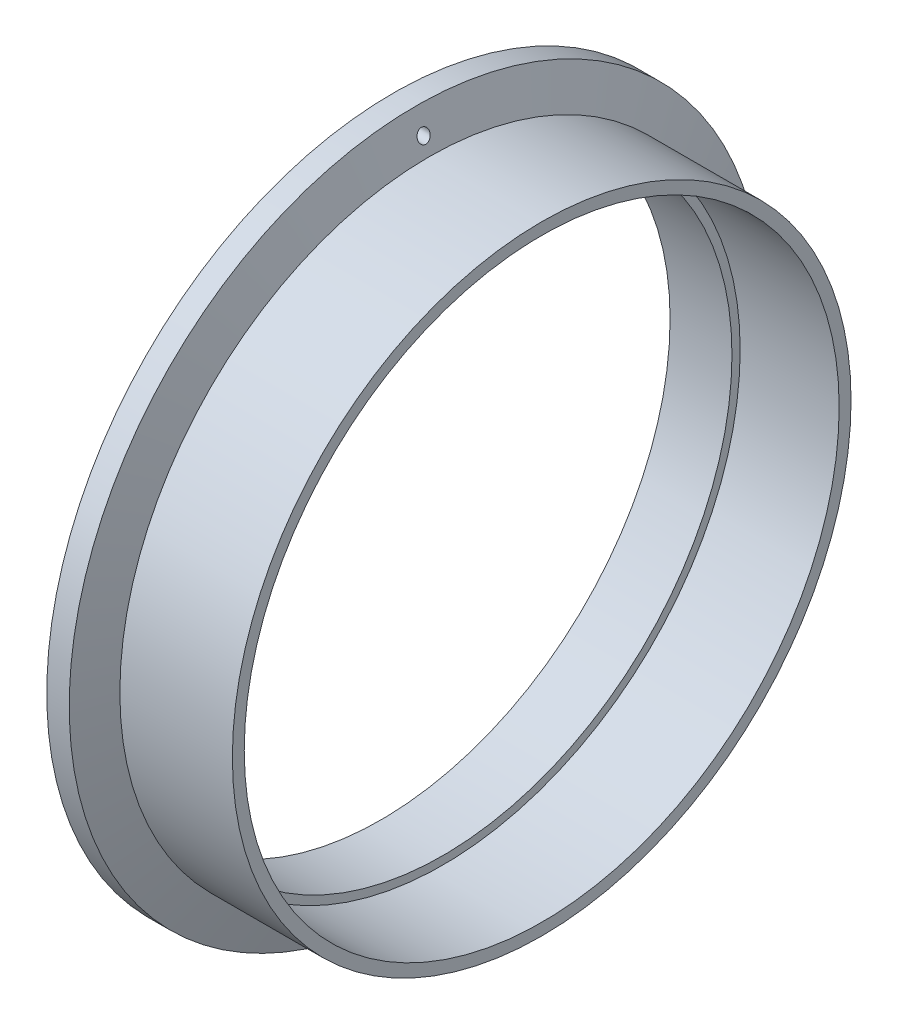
from build123d import *

# Parameters (mm, degrees)
SKETCH2_R          = 1.5875
CUT_EXTRUDE1_DEPTH = 132.369821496


with BuildPart() as part:
    # Sketch1 → Revolve1 (revolve)
    with BuildSketch(Plane.XY, mode=Mode.PRIVATE) as revolve1_sk:
        Polygon((38.1, 79.375), (9.232616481, 79.375), (5.7658, 88.9), (0, 88.9), (0, 80.137), (2.667, 80.137), (2.667, 76.073), (-2.667, 76.073), (-3.175, 75.565), (-3.175, 74.2188), (12.7, 74.2188), (12.7, 76.327), (38.1, 76.327), align=None)
    revolve(revolve1_sk.sketch.rotate(Axis((24.329960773, 0, 0), (-1, 0, 0)), 90), axis=Axis((24.329960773, 0, 0), (-1, 0, 0)))

    # Sketch2 → Cut-Extrude1 (cut, through all)
    with BuildSketch(Plane.ZY):
        with Locations((0, 83.312)):
            Circle(SKETCH2_R)
    extrude(amount=-CUT_EXTRUDE1_DEPTH, mode=Mode.SUBTRACT)


solid = part.part
